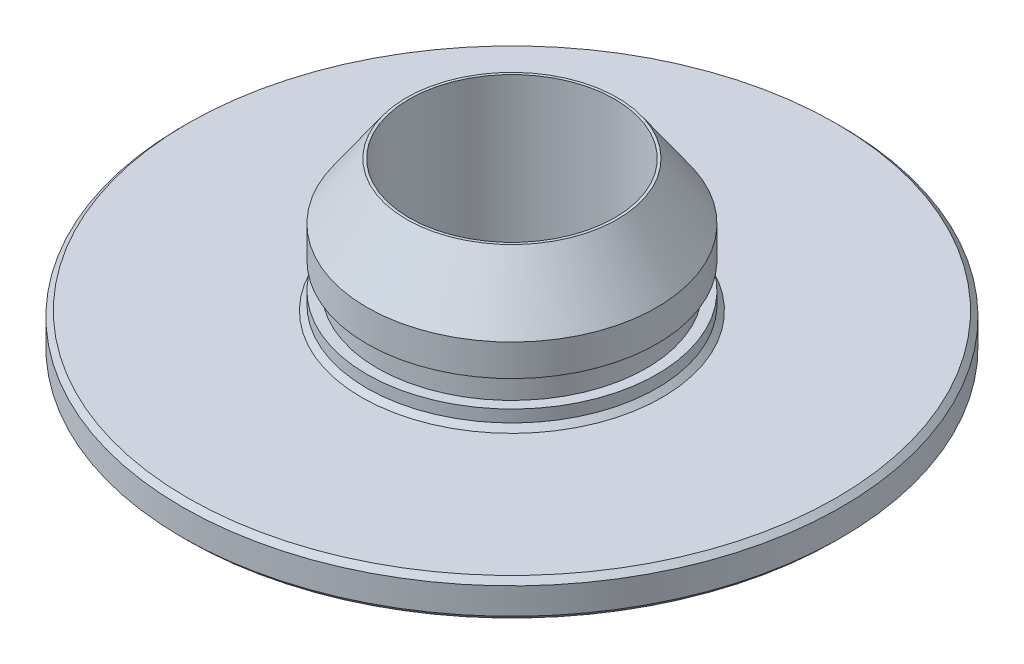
from build123d import *

# Parameters (mm, degrees)
SKETCH1_R          = 4.445
EXTRUDE1_DEPTH     = 1.016
SKETCH2_R          = 7.9375
EXTRUDE2_DEPTH     = 0.889
SKETCH3_R          = 3.4925
EXTRUDE3_DEPTH     = 3.175
SKETCH4_W          = 0.254
SKETCH4_H          = 0.635
SKETCH5_R          = 2.4765
CUT_EXTRUDE1_DEPTH = 13.321291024
CHAMFER1_SIZE      = 0.127


with BuildPart() as part:
    # Sketch1 → Extrude1 (new body)
    with BuildSketch(Plane(origin=(0, 0, 0), x_dir=(1, 0, 0), z_dir=(0, 1, 0))):
        with Locations(Location((0, 0, 0), (0, 0, 270))):
            Circle(SKETCH1_R)
    extrude(amount=EXTRUDE1_DEPTH)

    # Sketch2 → Extrude2 (add)
    with BuildSketch(Plane(origin=(0, 1.016, 0), x_dir=(-1, 0, 0), z_dir=(0, 1, 0))):
        with Locations(Location((0, 0, 0), (0, 0, 90))):
            Circle(SKETCH2_R)
    extrude(amount=EXTRUDE2_DEPTH)

    # Sketch3 → Extrude3 (add)
    with BuildSketch(Plane(origin=(0, 1.905, 0), x_dir=(-1, 0, 0), z_dir=(0, 1, 0))):
        with Locations(Location((0, 0, 0), (0, 0, 90))):
            Circle(SKETCH3_R)
    extrude(amount=EXTRUDE3_DEPTH)

    # Sketch4 → Cut-Revolve1 (revolve, cut)
    with BuildSketch(Plane.XY, mode=Mode.PRIVATE) as cut_revolve1_sk:
        Polygon((-2.54, 5.08), (-3.4925, 3.719689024), (-3.4925, 5.08), align=None)
        with Locations((-3.3655, 2.640189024)):
            Rectangle(SKETCH4_W, SKETCH4_H)
    revolve(cut_revolve1_sk.sketch.rotate(Axis((0, 5.08, 0), (0, -1, 0)), 270), axis=Axis((0, 5.08, 0), (0, -1, 0)), mode=Mode.SUBTRACT)

    # Sketch5 → Cut-Extrude1 (cut, through all)
    with BuildSketch(Plane(origin=(0, 5.08, 0), x_dir=(-1, 0, 0), z_dir=(0, 1, 0))):
        with Locations(Location((0, 0, 0), (0, 0, 90))):
            Circle(SKETCH5_R)
    extrude(amount=-CUT_EXTRUDE1_DEPTH, mode=Mode.SUBTRACT)

    # Chamfer1
    chamfer1_edges = [part.edges().sort_by_distance(p)[0] for p in [
        (0, 1.905, -3.4925),
        (0, 0, -4.445),
        (0, 0, -2.4765),
        (0, 1.016, -4.445),
        (0, 1.016, -7.9375),
        (0, 1.905, -7.9375),
    ]]
    chamfer(chamfer1_edges, length=CHAMFER1_SIZE)


solid = part.part
